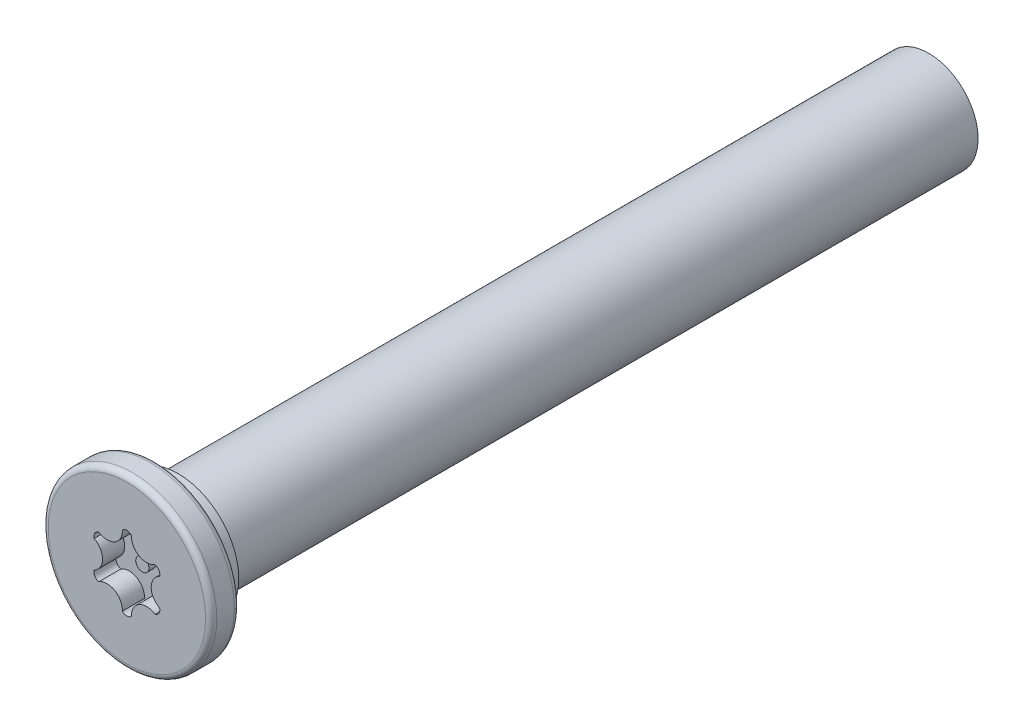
ISO-10303-21;
HEADER;
FILE_DESCRIPTION(('STEP AP214'),'2;1');
FILE_NAME('part.step','',(''),(''),'','','');
FILE_SCHEMA(('AUTOMOTIVE_DESIGN { 1 0 10303 214 1 1 1 1 }'));
ENDSEC;
DATA;
#1=APPLICATION_CONTEXT('core data for automotive mechanical design processes');
#2=APPLICATION_PROTOCOL_DEFINITION('international standard','automotive_design',2000,#1);
#3=PRODUCT_CONTEXT('',#1,'mechanical');
#4=PRODUCT('Part','Part','',(#3));
#5=PRODUCT_RELATED_PRODUCT_CATEGORY('part','',(#4));
#6=PRODUCT_DEFINITION_FORMATION('','',#4);
#7=PRODUCT_DEFINITION_CONTEXT('part definition',#1,'design');
#8=PRODUCT_DEFINITION('design','',#6,#7);
#9=PRODUCT_DEFINITION_SHAPE('','',#8);
#10=(LENGTH_UNIT() NAMED_UNIT(*) SI_UNIT(.MILLI.,.METRE.));
#11=(NAMED_UNIT(*) PLANE_ANGLE_UNIT() SI_UNIT($,.RADIAN.));
#12=(NAMED_UNIT(*) SI_UNIT($,.STERADIAN.) SOLID_ANGLE_UNIT());
#13=UNCERTAINTY_MEASURE_WITH_UNIT(LENGTH_MEASURE(1.E-05),#10,'distance_accuracy_value','');
#14=(GEOMETRIC_REPRESENTATION_CONTEXT(3) GLOBAL_UNCERTAINTY_ASSIGNED_CONTEXT((#13)) GLOBAL_UNIT_ASSIGNED_CONTEXT((#10,
#11,#12)) REPRESENTATION_CONTEXT('',''));
#15=CARTESIAN_POINT('',(0.,0.,0.));
#16=DIRECTION('',(0.,0.,1.));
#17=DIRECTION('',(1.,0.,0.));
#18=AXIS2_PLACEMENT_3D('',#15,#16,#17);
#19=CARTESIAN_POINT('',(0.,0.,0.));
#20=DIRECTION('',(0.,0.,1.));
#21=DIRECTION('',(1.,0.,0.));
#22=AXIS2_PLACEMENT_3D('',#19,#20,#21);
#23=PLANE('',#22);
#24=CARTESIAN_POINT('',(0.,0.,0.));
#25=DIRECTION('',(0.,0.,1.));
#26=DIRECTION('',(1.,0.,0.));
#27=AXIS2_PLACEMENT_3D('',#24,#25,#26);
#28=CIRCLE('',#27,3.55599999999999);
#29=CARTESIAN_POINT('',(3.55599999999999,0.,0.));
#30=VERTEX_POINT('',#29);
#31=EDGE_CURVE('E54',#30,#30,#28,.T.);
#32=ORIENTED_EDGE('',*,*,#31,.T.);
#33=EDGE_LOOP('',(#32));
#34=FACE_BOUND('',#33,.T.);
#35=CARTESIAN_POINT('',(0.893828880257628,1.54815703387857,0.));
#36=DIRECTION('',(0.,0.,1.));
#37=DIRECTION('',(1.,0.,0.));
#38=AXIS2_PLACEMENT_3D('',#35,#36,#37);
#39=CIRCLE('',#38,0.69);
#40=CARTESIAN_POINT('',(0.205060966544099,1.58937306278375,0.));
#41=VERTEX_POINT('',#40);
#42=CARTESIAN_POINT('',(1.27390696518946,0.972274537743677,0.));
#43=VERTEX_POINT('',#42);
#44=EDGE_CURVE('E181',#41,#43,#39,.T.);
#45=ORIENTED_EDGE('',*,*,#44,.T.);
#46=CARTESIAN_POINT('',(1.19884944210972,0.692156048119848,0.));
#47=DIRECTION('',(0.,0.,1.));
#48=DIRECTION('',(1.,0.,0.));
#49=AXIS2_PLACEMENT_3D('',#46,#47,#48);
#50=CIRCLE('',#49,0.29);
#51=CARTESIAN_POINT('',(1.47896793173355,0.617098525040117,0.));
#52=VERTEX_POINT('',#51);
#53=EDGE_CURVE('E61',#43,#52,#50,.F.);
#54=ORIENTED_EDGE('',*,*,#53,.T.);
#55=CARTESIAN_POINT('',(1.78765776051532,0.,0.));
#56=DIRECTION('',(0.,0.,1.));
#57=DIRECTION('',(1.,0.,0.));
#58=AXIS2_PLACEMENT_3D('',#55,#56,#57);
#59=CIRCLE('',#58,0.69);
#60=CARTESIAN_POINT('',(1.47896793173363,-0.617098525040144,0.));
#61=VERTEX_POINT('',#60);
#62=EDGE_CURVE('E111',#52,#61,#59,.T.);
#63=ORIENTED_EDGE('',*,*,#62,.T.);
#64=CARTESIAN_POINT('',(1.1988494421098,-0.692156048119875,0.));
#65=DIRECTION('',(0.,0.,1.));
#66=DIRECTION('',(1.,0.,0.));
#67=AXIS2_PLACEMENT_3D('',#64,#65,#66);
#68=CIRCLE('',#67,0.29);
#69=CARTESIAN_POINT('',(1.27390696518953,-0.972274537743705,0.));
#70=VERTEX_POINT('',#69);
#71=EDGE_CURVE('E216',#61,#70,#68,.F.);
#72=ORIENTED_EDGE('',*,*,#71,.T.);
#73=CARTESIAN_POINT('',(0.893828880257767,-1.54815703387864,0.));
#74=DIRECTION('',(0.,0.,1.));
#75=DIRECTION('',(1.,0.,0.));
#76=AXIS2_PLACEMENT_3D('',#73,#74,#75);
#77=CIRCLE('',#76,0.69);
#78=CARTESIAN_POINT('',(0.205060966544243,-1.5893730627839,0.));
#79=VERTEX_POINT('',#78);
#80=EDGE_CURVE('E160',#70,#79,#77,.T.);
#81=ORIENTED_EDGE('',*,*,#80,.T.);
#82=CARTESIAN_POINT('',(1.43067375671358E-13,-1.3843120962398,0.));
#83=DIRECTION('',(0.,0.,1.));
#84=DIRECTION('',(1.,0.,0.));
#85=AXIS2_PLACEMENT_3D('',#82,#83,#84);
#86=CIRCLE('',#85,0.29);
#87=CARTESIAN_POINT('',(-0.205060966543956,-1.5893730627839,0.));
#88=VERTEX_POINT('',#87);
#89=EDGE_CURVE('E210',#79,#88,#86,.F.);
#90=ORIENTED_EDGE('',*,*,#89,.T.);
#91=CARTESIAN_POINT('',(-0.893828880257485,-1.54815703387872,0.));
#92=DIRECTION('',(0.,0.,1.));
#93=DIRECTION('',(1.,0.,0.));
#94=AXIS2_PLACEMENT_3D('',#91,#92,#93);
#95=CIRCLE('',#94,0.69);
#96=CARTESIAN_POINT('',(-1.27390696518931,-0.97227453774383,0.));
#97=VERTEX_POINT('',#96);
#98=EDGE_CURVE('E206',#88,#97,#95,.T.);
#99=ORIENTED_EDGE('',*,*,#98,.T.);
#100=CARTESIAN_POINT('',(-1.19884944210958,-0.69215604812,0.));
#101=DIRECTION('',(0.,0.,1.));
#102=DIRECTION('',(1.,0.,0.));
#103=AXIS2_PLACEMENT_3D('',#100,#101,#102);
#104=CIRCLE('',#103,0.29);
#105=CARTESIAN_POINT('',(-1.47896793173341,-0.617098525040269,0.));
#106=VERTEX_POINT('',#105);
#107=EDGE_CURVE('E202',#97,#106,#104,.F.);
#108=ORIENTED_EDGE('',*,*,#107,.T.);
#109=CARTESIAN_POINT('',(-1.78765776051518,-1.56674837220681E-13,0.));
#110=DIRECTION('',(0.,0.,1.));
#111=DIRECTION('',(1.,0.,0.));
#112=AXIS2_PLACEMENT_3D('',#109,#110,#111);
#113=CIRCLE('',#112,0.69);
#114=CARTESIAN_POINT('',(-1.47896793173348,0.617098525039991,0.));
#115=VERTEX_POINT('',#114);
#116=EDGE_CURVE('E198',#106,#115,#113,.T.);
#117=ORIENTED_EDGE('',*,*,#116,.T.);
#118=CARTESIAN_POINT('',(-1.19884944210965,0.692156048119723,0.));
#119=DIRECTION('',(0.,0.,1.));
#120=DIRECTION('',(1.,0.,0.));
#121=AXIS2_PLACEMENT_3D('',#118,#119,#120);
#122=CIRCLE('',#121,0.29);
#123=CARTESIAN_POINT('',(-1.27390696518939,0.972274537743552,0.));
#124=VERTEX_POINT('',#123);
#125=EDGE_CURVE('E194',#115,#124,#122,.F.);
#126=ORIENTED_EDGE('',*,*,#125,.T.);
#127=CARTESIAN_POINT('',(-0.893828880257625,1.54815703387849,0.));
#128=DIRECTION('',(0.,0.,1.));
#129=DIRECTION('',(1.,0.,0.));
#130=AXIS2_PLACEMENT_3D('',#127,#128,#129);
#131=CIRCLE('',#130,0.690000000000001);
#132=CARTESIAN_POINT('',(-0.205060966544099,1.58937306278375,0.));
#133=VERTEX_POINT('',#132);
#134=EDGE_CURVE('E190',#124,#133,#131,.T.);
#135=ORIENTED_EDGE('',*,*,#134,.T.);
#136=CARTESIAN_POINT('',(0.,1.38431209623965,0.));
#137=DIRECTION('',(0.,0.,1.));
#138=DIRECTION('',(1.,0.,0.));
#139=AXIS2_PLACEMENT_3D('',#136,#137,#138);
#140=CIRCLE('',#139,0.29);
#141=EDGE_CURVE('E186',#133,#41,#140,.F.);
#142=ORIENTED_EDGE('',*,*,#141,.T.);
#143=EDGE_LOOP('',(#45,#54,#63,#72,#81,#90,#99,#108,#117,#126,#135,#142));
#144=FACE_BOUND('',#143,.T.);
#145=ADVANCED_FACE('F45',(#34,#144),#23,.T.);
#146=CARTESIAN_POINT('',(0.,0.,-1.3));
#147=DIRECTION('',(0.,0.,1.));
#148=DIRECTION('',(1.,0.,0.));
#149=AXIS2_PLACEMENT_3D('',#146,#147,#148);
#150=PLANE('',#149);
#151=CARTESIAN_POINT('',(0.,0.,-1.3));
#152=DIRECTION('',(0.,0.,1.));
#153=DIRECTION('',(1.,0.,0.));
#154=AXIS2_PLACEMENT_3D('',#151,#152,#153);
#155=CIRCLE('',#154,2.738000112);
#156=CARTESIAN_POINT('',(2.738000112,0.,-1.3));
#157=VERTEX_POINT('',#156);
#158=EDGE_CURVE('E11',#157,#157,#155,.F.);
#159=ORIENTED_EDGE('',*,*,#158,.F.);
#160=EDGE_LOOP('',(#159));
#161=FACE_BOUND('',#160,.T.);
#162=CARTESIAN_POINT('',(0.,0.,-1.3));
#163=DIRECTION('',(0.,0.,1.));
#164=DIRECTION('',(1.,0.,0.));
#165=AXIS2_PLACEMENT_3D('',#162,#163,#164);
#166=CIRCLE('',#165,3.55599999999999);
#167=CARTESIAN_POINT('',(3.55599999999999,0.,-1.3));
#168=VERTEX_POINT('',#167);
#169=EDGE_CURVE('E260',#168,#168,#166,.F.);
#170=ORIENTED_EDGE('',*,*,#169,.T.);
#171=EDGE_LOOP('',(#170));
#172=FACE_BOUND('',#171,.T.);
#173=ADVANCED_FACE('F283',(#161,#172),#150,.F.);
#174=CARTESIAN_POINT('',(0.,0.,-1.3));
#175=DIRECTION('',(0.,0.,1.));
#176=DIRECTION('',(1.,0.,0.));
#177=AXIS2_PLACEMENT_3D('',#174,#175,#176);
#178=CYLINDRICAL_SURFACE('',#177,3.80999999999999);
#179=CARTESIAN_POINT('',(0.,0.,-1.046));
#180=DIRECTION('',(0.,0.,1.));
#181=DIRECTION('',(1.,0.,0.));
#182=AXIS2_PLACEMENT_3D('',#179,#180,#181);
#183=CIRCLE('',#182,3.80999999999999);
#184=CARTESIAN_POINT('',(3.80999999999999,0.,-1.046));
#185=VERTEX_POINT('',#184);
#186=EDGE_CURVE('E256',#185,#185,#183,.T.);
#187=ORIENTED_EDGE('',*,*,#186,.T.);
#188=EDGE_LOOP('',(#187));
#189=FACE_BOUND('',#188,.T.);
#190=CARTESIAN_POINT('',(0.,0.,-0.254));
#191=DIRECTION('',(0.,0.,1.));
#192=DIRECTION('',(1.,0.,0.));
#193=AXIS2_PLACEMENT_3D('',#190,#191,#192);
#194=CIRCLE('',#193,3.80999999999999);
#195=CARTESIAN_POINT('',(3.80999999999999,0.,-0.254));
#196=VERTEX_POINT('',#195);
#197=EDGE_CURVE('E225',#196,#196,#194,.F.);
#198=ORIENTED_EDGE('',*,*,#197,.T.);
#199=EDGE_LOOP('',(#198));
#200=FACE_BOUND('',#199,.T.);
#201=ADVANCED_FACE('F289',(#189,#200),#178,.T.);
#202=CARTESIAN_POINT('',(1.19884944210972,0.692156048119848,-1.));
#203=DIRECTION('',(0.,0.,1.));
#204=DIRECTION('',(1.,0.,0.));
#205=AXIS2_PLACEMENT_3D('',#202,#203,#204);
#206=CYLINDRICAL_SURFACE('',#205,0.29);
#207=ORIENTED_EDGE('',*,*,#53,.F.);
#208=DIRECTION('',(0.,0.,1.));
#209=VECTOR('',#208,1.);
#210=CARTESIAN_POINT('',(1.27390696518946,0.972274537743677,-1.));
#211=LINE('',#210,#209);
#212=CARTESIAN_POINT('',(1.27390696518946,0.972274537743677,-1.));
#213=VERTEX_POINT('',#212);
#214=EDGE_CURVE('E178',#213,#43,#211,.T.);
#215=ORIENTED_EDGE('',*,*,#214,.F.);
#216=CARTESIAN_POINT('',(1.19884944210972,0.692156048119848,-1.));
#217=DIRECTION('',(0.,0.,1.));
#218=DIRECTION('',(1.,0.,0.));
#219=AXIS2_PLACEMENT_3D('',#216,#217,#218);
#220=CIRCLE('',#219,0.29);
#221=CARTESIAN_POINT('',(1.47896793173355,0.617098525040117,-1.));
#222=VERTEX_POINT('',#221);
#223=EDGE_CURVE('E221',#213,#222,#220,.F.);
#224=ORIENTED_EDGE('',*,*,#223,.T.);
#225=DIRECTION('',(0.,0.,1.));
#226=VECTOR('',#225,1.);
#227=CARTESIAN_POINT('',(1.47896793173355,0.617098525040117,-1.));
#228=LINE('',#227,#226);
#229=EDGE_CURVE('E222',#222,#52,#228,.T.);
#230=ORIENTED_EDGE('',*,*,#229,.T.);
#231=EDGE_LOOP('',(#207,#215,#224,#230));
#232=FACE_BOUND('',#231,.T.);
#233=ADVANCED_FACE('F294',(#232),#206,.F.);
#234=CARTESIAN_POINT('',(1.78765776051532,0.,-1.));
#235=DIRECTION('',(0.,0.,1.));
#236=DIRECTION('',(1.,0.,0.));
#237=AXIS2_PLACEMENT_3D('',#234,#235,#236);
#238=CYLINDRICAL_SURFACE('',#237,0.69);
#239=ORIENTED_EDGE('',*,*,#62,.F.);
#240=ORIENTED_EDGE('',*,*,#229,.F.);
#241=CARTESIAN_POINT('',(1.78765776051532,0.,-1.));
#242=DIRECTION('',(0.,0.,1.));
#243=DIRECTION('',(1.,0.,0.));
#244=AXIS2_PLACEMENT_3D('',#241,#242,#243);
#245=CIRCLE('',#244,0.69);
#246=CARTESIAN_POINT('',(1.47896793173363,-0.617098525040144,-1.));
#247=VERTEX_POINT('',#246);
#248=EDGE_CURVE('E70',#222,#247,#245,.T.);
#249=ORIENTED_EDGE('',*,*,#248,.T.);
#250=DIRECTION('',(0.,0.,1.));
#251=VECTOR('',#250,1.);
#252=CARTESIAN_POINT('',(1.47896793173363,-0.617098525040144,-1.));
#253=LINE('',#252,#251);
#254=EDGE_CURVE('E151',#247,#61,#253,.T.);
#255=ORIENTED_EDGE('',*,*,#254,.T.);
#256=EDGE_LOOP('',(#239,#240,#249,#255));
#257=FACE_BOUND('',#256,.T.);
#258=ADVANCED_FACE('F301',(#257),#238,.T.);
#259=CARTESIAN_POINT('',(1.1988494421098,-0.692156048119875,-1.));
#260=DIRECTION('',(0.,0.,1.));
#261=DIRECTION('',(1.,0.,0.));
#262=AXIS2_PLACEMENT_3D('',#259,#260,#261);
#263=CYLINDRICAL_SURFACE('',#262,0.29);
#264=ORIENTED_EDGE('',*,*,#71,.F.);
#265=ORIENTED_EDGE('',*,*,#254,.F.);
#266=CARTESIAN_POINT('',(1.1988494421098,-0.692156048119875,-1.));
#267=DIRECTION('',(0.,0.,1.));
#268=DIRECTION('',(1.,0.,0.));
#269=AXIS2_PLACEMENT_3D('',#266,#267,#268);
#270=CIRCLE('',#269,0.29);
#271=CARTESIAN_POINT('',(1.27390696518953,-0.972274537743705,-1.));
#272=VERTEX_POINT('',#271);
#273=EDGE_CURVE('E145',#247,#272,#270,.F.);
#274=ORIENTED_EDGE('',*,*,#273,.T.);
#275=DIRECTION('',(0.,0.,1.));
#276=VECTOR('',#275,1.);
#277=CARTESIAN_POINT('',(1.27390696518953,-0.972274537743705,-1.));
#278=LINE('',#277,#276);
#279=EDGE_CURVE('E149',#272,#70,#278,.T.);
#280=ORIENTED_EDGE('',*,*,#279,.T.);
#281=EDGE_LOOP('',(#264,#265,#274,#280));
#282=FACE_BOUND('',#281,.T.);
#283=ADVANCED_FACE('F148',(#282),#263,.F.);
#284=CARTESIAN_POINT('',(0.893828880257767,-1.54815703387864,-1.));
#285=DIRECTION('',(0.,0.,1.));
#286=DIRECTION('',(1.,0.,0.));
#287=AXIS2_PLACEMENT_3D('',#284,#285,#286);
#288=CYLINDRICAL_SURFACE('',#287,0.69);
#289=ORIENTED_EDGE('',*,*,#80,.F.);
#290=ORIENTED_EDGE('',*,*,#279,.F.);
#291=CARTESIAN_POINT('',(0.893828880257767,-1.54815703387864,-1.));
#292=DIRECTION('',(0.,0.,1.));
#293=DIRECTION('',(1.,0.,0.));
#294=AXIS2_PLACEMENT_3D('',#291,#292,#293);
#295=CIRCLE('',#294,0.69);
#296=CARTESIAN_POINT('',(0.205060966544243,-1.5893730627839,-1.));
#297=VERTEX_POINT('',#296);
#298=EDGE_CURVE('E154',#272,#297,#295,.T.);
#299=ORIENTED_EDGE('',*,*,#298,.T.);
#300=DIRECTION('',(0.,0.,1.));
#301=VECTOR('',#300,1.);
#302=CARTESIAN_POINT('',(0.205060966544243,-1.5893730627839,-1.));
#303=LINE('',#302,#301);
#304=EDGE_CURVE('E163',#297,#79,#303,.T.);
#305=ORIENTED_EDGE('',*,*,#304,.T.);
#306=EDGE_LOOP('',(#289,#290,#299,#305));
#307=FACE_BOUND('',#306,.T.);
#308=ADVANCED_FACE('F157',(#307),#288,.T.);
#309=CARTESIAN_POINT('',(1.43067375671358E-13,-1.3843120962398,-1.));
#310=DIRECTION('',(0.,0.,1.));
#311=DIRECTION('',(1.,0.,0.));
#312=AXIS2_PLACEMENT_3D('',#309,#310,#311);
#313=CYLINDRICAL_SURFACE('',#312,0.29);
#314=ORIENTED_EDGE('',*,*,#89,.F.);
#315=ORIENTED_EDGE('',*,*,#304,.F.);
#316=CARTESIAN_POINT('',(1.43067375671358E-13,-1.3843120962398,-1.));
#317=DIRECTION('',(0.,0.,1.));
#318=DIRECTION('',(1.,0.,0.));
#319=AXIS2_PLACEMENT_3D('',#316,#317,#318);
#320=CIRCLE('',#319,0.29);
#321=CARTESIAN_POINT('',(-0.205060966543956,-1.5893730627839,-1.));
#322=VERTEX_POINT('',#321);
#323=EDGE_CURVE('E168',#297,#322,#320,.F.);
#324=ORIENTED_EDGE('',*,*,#323,.T.);
#325=DIRECTION('',(0.,0.,1.));
#326=VECTOR('',#325,1.);
#327=CARTESIAN_POINT('',(-0.205060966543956,-1.5893730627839,-1.));
#328=LINE('',#327,#326);
#329=EDGE_CURVE('E230',#322,#88,#328,.T.);
#330=ORIENTED_EDGE('',*,*,#329,.T.);
#331=EDGE_LOOP('',(#314,#315,#324,#330));
#332=FACE_BOUND('',#331,.T.);
#333=ADVANCED_FACE('F318',(#332),#313,.F.);
#334=CARTESIAN_POINT('',(-0.893828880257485,-1.54815703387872,-1.));
#335=DIRECTION('',(0.,0.,1.));
#336=DIRECTION('',(1.,0.,0.));
#337=AXIS2_PLACEMENT_3D('',#334,#335,#336);
#338=CYLINDRICAL_SURFACE('',#337,0.69);
#339=ORIENTED_EDGE('',*,*,#98,.F.);
#340=ORIENTED_EDGE('',*,*,#329,.F.);
#341=CARTESIAN_POINT('',(-0.893828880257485,-1.54815703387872,-1.));
#342=DIRECTION('',(0.,0.,1.));
#343=DIRECTION('',(1.,0.,0.));
#344=AXIS2_PLACEMENT_3D('',#341,#342,#343);
#345=CIRCLE('',#344,0.69);
#346=CARTESIAN_POINT('',(-1.27390696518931,-0.97227453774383,-1.));
#347=VERTEX_POINT('',#346);
#348=EDGE_CURVE('E172',#322,#347,#345,.T.);
#349=ORIENTED_EDGE('',*,*,#348,.T.);
#350=DIRECTION('',(0.,0.,1.));
#351=VECTOR('',#350,1.);
#352=CARTESIAN_POINT('',(-1.27390696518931,-0.97227453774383,-1.));
#353=LINE('',#352,#351);
#354=EDGE_CURVE('E233',#347,#97,#353,.T.);
#355=ORIENTED_EDGE('',*,*,#354,.T.);
#356=EDGE_LOOP('',(#339,#340,#349,#355));
#357=FACE_BOUND('',#356,.T.);
#358=ADVANCED_FACE('F321',(#357),#338,.T.);
#359=CARTESIAN_POINT('',(-1.19884944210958,-0.69215604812,-1.));
#360=DIRECTION('',(0.,0.,1.));
#361=DIRECTION('',(1.,0.,0.));
#362=AXIS2_PLACEMENT_3D('',#359,#360,#361);
#363=CYLINDRICAL_SURFACE('',#362,0.29);
#364=ORIENTED_EDGE('',*,*,#107,.F.);
#365=ORIENTED_EDGE('',*,*,#354,.F.);
#366=CARTESIAN_POINT('',(-1.19884944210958,-0.69215604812,-1.));
#367=DIRECTION('',(0.,0.,1.));
#368=DIRECTION('',(1.,0.,0.));
#369=AXIS2_PLACEMENT_3D('',#366,#367,#368);
#370=CIRCLE('',#369,0.29);
#371=CARTESIAN_POINT('',(-1.47896793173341,-0.617098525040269,-1.));
#372=VERTEX_POINT('',#371);
#373=EDGE_CURVE('E374',#347,#372,#370,.F.);
#374=ORIENTED_EDGE('',*,*,#373,.T.);
#375=DIRECTION('',(0.,0.,1.));
#376=VECTOR('',#375,1.);
#377=CARTESIAN_POINT('',(-1.47896793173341,-0.617098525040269,-1.));
#378=LINE('',#377,#376);
#379=EDGE_CURVE('E236',#372,#106,#378,.T.);
#380=ORIENTED_EDGE('',*,*,#379,.T.);
#381=EDGE_LOOP('',(#364,#365,#374,#380));
#382=FACE_BOUND('',#381,.T.);
#383=ADVANCED_FACE('F325',(#382),#363,.F.);
#384=CARTESIAN_POINT('',(-1.78765776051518,-1.56674837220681E-13,-1.));
#385=DIRECTION('',(0.,0.,1.));
#386=DIRECTION('',(1.,0.,0.));
#387=AXIS2_PLACEMENT_3D('',#384,#385,#386);
#388=CYLINDRICAL_SURFACE('',#387,0.69);
#389=ORIENTED_EDGE('',*,*,#116,.F.);
#390=ORIENTED_EDGE('',*,*,#379,.F.);
#391=CARTESIAN_POINT('',(-1.78765776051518,-1.56674837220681E-13,-1.));
#392=DIRECTION('',(0.,0.,1.));
#393=DIRECTION('',(1.,0.,0.));
#394=AXIS2_PLACEMENT_3D('',#391,#392,#393);
#395=CIRCLE('',#394,0.69);
#396=CARTESIAN_POINT('',(-1.47896793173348,0.617098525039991,-1.));
#397=VERTEX_POINT('',#396);
#398=EDGE_CURVE('E371',#372,#397,#395,.T.);
#399=ORIENTED_EDGE('',*,*,#398,.T.);
#400=DIRECTION('',(0.,0.,1.));
#401=VECTOR('',#400,1.);
#402=CARTESIAN_POINT('',(-1.47896793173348,0.617098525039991,-1.));
#403=LINE('',#402,#401);
#404=EDGE_CURVE('E239',#397,#115,#403,.T.);
#405=ORIENTED_EDGE('',*,*,#404,.T.);
#406=EDGE_LOOP('',(#389,#390,#399,#405));
#407=FACE_BOUND('',#406,.T.);
#408=ADVANCED_FACE('F329',(#407),#388,.T.);
#409=CARTESIAN_POINT('',(-1.19884944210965,0.692156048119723,-1.));
#410=DIRECTION('',(0.,0.,1.));
#411=DIRECTION('',(1.,0.,0.));
#412=AXIS2_PLACEMENT_3D('',#409,#410,#411);
#413=CYLINDRICAL_SURFACE('',#412,0.29);
#414=ORIENTED_EDGE('',*,*,#125,.F.);
#415=ORIENTED_EDGE('',*,*,#404,.F.);
#416=CARTESIAN_POINT('',(-1.19884944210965,0.692156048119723,-1.));
#417=DIRECTION('',(0.,0.,1.));
#418=DIRECTION('',(1.,0.,0.));
#419=AXIS2_PLACEMENT_3D('',#416,#417,#418);
#420=CIRCLE('',#419,0.29);
#421=CARTESIAN_POINT('',(-1.27390696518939,0.972274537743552,-1.));
#422=VERTEX_POINT('',#421);
#423=EDGE_CURVE('E364',#397,#422,#420,.F.);
#424=ORIENTED_EDGE('',*,*,#423,.T.);
#425=DIRECTION('',(0.,0.,1.));
#426=VECTOR('',#425,1.);
#427=CARTESIAN_POINT('',(-1.27390696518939,0.972274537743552,-1.));
#428=LINE('',#427,#426);
#429=EDGE_CURVE('E242',#422,#124,#428,.T.);
#430=ORIENTED_EDGE('',*,*,#429,.T.);
#431=EDGE_LOOP('',(#414,#415,#424,#430));
#432=FACE_BOUND('',#431,.T.);
#433=ADVANCED_FACE('F333',(#432),#413,.F.);
#434=CARTESIAN_POINT('',(-0.893828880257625,1.54815703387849,-1.));
#435=DIRECTION('',(0.,0.,1.));
#436=DIRECTION('',(1.,0.,0.));
#437=AXIS2_PLACEMENT_3D('',#434,#435,#436);
#438=CYLINDRICAL_SURFACE('',#437,0.690000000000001);
#439=ORIENTED_EDGE('',*,*,#134,.F.);
#440=ORIENTED_EDGE('',*,*,#429,.F.);
#441=CARTESIAN_POINT('',(-0.893828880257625,1.54815703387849,-1.));
#442=DIRECTION('',(0.,0.,1.));
#443=DIRECTION('',(1.,0.,0.));
#444=AXIS2_PLACEMENT_3D('',#441,#442,#443);
#445=CIRCLE('',#444,0.690000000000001);
#446=CARTESIAN_POINT('',(-0.205060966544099,1.58937306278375,-1.));
#447=VERTEX_POINT('',#446);
#448=EDGE_CURVE('E360',#422,#447,#445,.T.);
#449=ORIENTED_EDGE('',*,*,#448,.T.);
#450=DIRECTION('',(0.,0.,1.));
#451=VECTOR('',#450,1.);
#452=CARTESIAN_POINT('',(-0.205060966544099,1.58937306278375,-1.));
#453=LINE('',#452,#451);
#454=EDGE_CURVE('E245',#447,#133,#453,.T.);
#455=ORIENTED_EDGE('',*,*,#454,.T.);
#456=EDGE_LOOP('',(#439,#440,#449,#455));
#457=FACE_BOUND('',#456,.T.);
#458=ADVANCED_FACE('F337',(#457),#438,.T.);
#459=CARTESIAN_POINT('',(0.,1.38431209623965,-1.));
#460=DIRECTION('',(0.,0.,1.));
#461=DIRECTION('',(1.,0.,0.));
#462=AXIS2_PLACEMENT_3D('',#459,#460,#461);
#463=CYLINDRICAL_SURFACE('',#462,0.29);
#464=ORIENTED_EDGE('',*,*,#141,.F.);
#465=ORIENTED_EDGE('',*,*,#454,.F.);
#466=CARTESIAN_POINT('',(0.,1.38431209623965,-1.));
#467=DIRECTION('',(0.,0.,1.));
#468=DIRECTION('',(1.,0.,0.));
#469=AXIS2_PLACEMENT_3D('',#466,#467,#468);
#470=CIRCLE('',#469,0.29);
#471=CARTESIAN_POINT('',(0.205060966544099,1.58937306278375,-1.));
#472=VERTEX_POINT('',#471);
#473=EDGE_CURVE('E357',#447,#472,#470,.F.);
#474=ORIENTED_EDGE('',*,*,#473,.T.);
#475=DIRECTION('',(0.,0.,1.));
#476=VECTOR('',#475,1.);
#477=CARTESIAN_POINT('',(0.205060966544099,1.58937306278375,-1.));
#478=LINE('',#477,#476);
#479=EDGE_CURVE('E248',#472,#41,#478,.T.);
#480=ORIENTED_EDGE('',*,*,#479,.T.);
#481=EDGE_LOOP('',(#464,#465,#474,#480));
#482=FACE_BOUND('',#481,.T.);
#483=ADVANCED_FACE('F341',(#482),#463,.F.);
#484=CARTESIAN_POINT('',(0.893828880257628,1.54815703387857,-1.));
#485=DIRECTION('',(0.,0.,1.));
#486=DIRECTION('',(1.,0.,0.));
#487=AXIS2_PLACEMENT_3D('',#484,#485,#486);
#488=CYLINDRICAL_SURFACE('',#487,0.69);
#489=ORIENTED_EDGE('',*,*,#44,.F.);
#490=ORIENTED_EDGE('',*,*,#479,.F.);
#491=CARTESIAN_POINT('',(0.893828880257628,1.54815703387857,-1.));
#492=DIRECTION('',(0.,0.,1.));
#493=DIRECTION('',(1.,0.,0.));
#494=AXIS2_PLACEMENT_3D('',#491,#492,#493);
#495=CIRCLE('',#494,0.69);
#496=EDGE_CURVE('E118',#472,#213,#495,.T.);
#497=ORIENTED_EDGE('',*,*,#496,.T.);
#498=ORIENTED_EDGE('',*,*,#214,.T.);
#499=EDGE_LOOP('',(#489,#490,#497,#498));
#500=FACE_BOUND('',#499,.T.);
#501=ADVANCED_FACE('F344',(#500),#488,.T.);
#502=CARTESIAN_POINT('',(0.,0.,-1.));
#503=DIRECTION('',(0.,0.,1.));
#504=DIRECTION('',(1.,0.,0.));
#505=AXIS2_PLACEMENT_3D('',#502,#503,#504);
#506=PLANE('',#505);
#507=CARTESIAN_POINT('',(0.,0.,-1.));
#508=DIRECTION('',(0.,0.,1.));
#509=DIRECTION('',(1.,0.,0.));
#510=AXIS2_PLACEMENT_3D('',#507,#508,#509);
#511=CIRCLE('',#510,0.3);
#512=CARTESIAN_POINT('',(0.3,0.,-1.));
#513=VERTEX_POINT('',#512);
#514=EDGE_CURVE('E396',#513,#513,#511,.T.);
#515=ORIENTED_EDGE('',*,*,#514,.F.);
#516=EDGE_LOOP('',(#515));
#517=FACE_BOUND('',#516,.T.);
#518=ORIENTED_EDGE('',*,*,#223,.F.);
#519=ORIENTED_EDGE('',*,*,#496,.F.);
#520=ORIENTED_EDGE('',*,*,#473,.F.);
#521=ORIENTED_EDGE('',*,*,#448,.F.);
#522=ORIENTED_EDGE('',*,*,#423,.F.);
#523=ORIENTED_EDGE('',*,*,#398,.F.);
#524=ORIENTED_EDGE('',*,*,#373,.F.);
#525=ORIENTED_EDGE('',*,*,#348,.F.);
#526=ORIENTED_EDGE('',*,*,#323,.F.);
#527=ORIENTED_EDGE('',*,*,#298,.F.);
#528=ORIENTED_EDGE('',*,*,#273,.F.);
#529=ORIENTED_EDGE('',*,*,#248,.F.);
#530=EDGE_LOOP('',(#518,#519,#520,#521,#522,#523,#524,#525,#526,#527,#528,#529));
#531=FACE_BOUND('',#530,.T.);
#532=ADVANCED_FACE('F166',(#517,#531),#506,.T.);
#533=CARTESIAN_POINT('',(0.,0.,-1.046));
#534=DIRECTION('',(0.,0.,1.));
#535=DIRECTION('',(1.,0.,0.));
#536=AXIS2_PLACEMENT_3D('',#533,#534,#535);
#537=TOROIDAL_SURFACE('',#536,3.55599999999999,0.254);
#538=ORIENTED_EDGE('',*,*,#169,.F.);
#539=EDGE_LOOP('',(#538));
#540=FACE_BOUND('',#539,.T.);
#541=ORIENTED_EDGE('',*,*,#186,.F.);
#542=EDGE_LOOP('',(#541));
#543=FACE_BOUND('',#542,.T.);
#544=ADVANCED_FACE('F271',(#540,#543),#537,.T.);
#545=CARTESIAN_POINT('',(0.,0.,-0.254));
#546=DIRECTION('',(0.,0.,1.));
#547=DIRECTION('',(1.,0.,0.));
#548=AXIS2_PLACEMENT_3D('',#545,#546,#547);
#549=TOROIDAL_SURFACE('',#548,3.55599999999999,0.254);
#550=ORIENTED_EDGE('',*,*,#197,.F.);
#551=EDGE_LOOP('',(#550));
#552=FACE_BOUND('',#551,.T.);
#553=ORIENTED_EDGE('',*,*,#31,.F.);
#554=EDGE_LOOP('',(#553));
#555=FACE_BOUND('',#554,.T.);
#556=ADVANCED_FACE('F47',(#552,#555),#549,.T.);
#557=CARTESIAN_POINT('',(0.,0.,-2.316));
#558=DIRECTION('',(0.,0.,-1.));
#559=DIRECTION('',(-1.,0.,0.));
#560=AXIS2_PLACEMENT_3D('',#557,#558,#559);
#561=PLANE('',#560);
#562=CARTESIAN_POINT('',(0.,0.,-2.316));
#563=DIRECTION('',(0.,0.,-1.));
#564=DIRECTION('',(-1.,0.,0.));
#565=AXIS2_PLACEMENT_3D('',#562,#563,#564);
#566=CIRCLE('',#565,2.738000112);
#567=CARTESIAN_POINT('',(-2.738000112,0.,-2.316));
#568=VERTEX_POINT('',#567);
#569=EDGE_CURVE('E182',#568,#568,#566,.T.);
#570=ORIENTED_EDGE('',*,*,#569,.T.);
#571=EDGE_LOOP('',(#570));
#572=FACE_BOUND('',#571,.T.);
#573=CARTESIAN_POINT('',(0.,0.,-2.316));
#574=DIRECTION('',(0.,0.,-1.));
#575=DIRECTION('',(-1.,0.,0.));
#576=AXIS2_PLACEMENT_3D('',#573,#574,#575);
#577=CIRCLE('',#576,2.230000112);
#578=CARTESIAN_POINT('',(-2.230000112,0.,-2.316));
#579=VERTEX_POINT('',#578);
#580=EDGE_CURVE('E400',#579,#579,#577,.T.);
#581=ORIENTED_EDGE('',*,*,#580,.F.);
#582=EDGE_LOOP('',(#581));
#583=FACE_BOUND('',#582,.T.);
#584=ADVANCED_FACE('F270',(#572,#583),#561,.T.);
#585=CARTESIAN_POINT('',(0.,0.,-2.316));
#586=DIRECTION('',(0.,0.,1.));
#587=DIRECTION('',(1.,0.,0.));
#588=AXIS2_PLACEMENT_3D('',#585,#586,#587);
#589=CYLINDRICAL_SURFACE('',#588,2.738000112);
#590=ORIENTED_EDGE('',*,*,#569,.F.);
#591=EDGE_LOOP('',(#590));
#592=FACE_BOUND('',#591,.T.);
#593=ORIENTED_EDGE('',*,*,#158,.T.);
#594=EDGE_LOOP('',(#593));
#595=FACE_BOUND('',#594,.T.);
#596=ADVANCED_FACE('F277',(#592,#595),#589,.T.);
#597=CARTESIAN_POINT('',(0.,0.,-0.7));
#598=DIRECTION('',(0.,0.,-1.));
#599=DIRECTION('',(-1.,0.,0.));
#600=AXIS2_PLACEMENT_3D('',#597,#598,#599);
#601=CYLINDRICAL_SURFACE('',#600,0.3);
#602=CARTESIAN_POINT('',(0.,0.,-0.7));
#603=DIRECTION('',(0.,0.,1.));
#604=DIRECTION('',(1.,0.,0.));
#605=AXIS2_PLACEMENT_3D('',#602,#603,#604);
#606=CIRCLE('',#605,0.3);
#607=CARTESIAN_POINT('',(0.3,0.,-0.7));
#608=VERTEX_POINT('',#607);
#609=EDGE_CURVE('E395',#608,#608,#606,.T.);
#610=ORIENTED_EDGE('',*,*,#609,.F.);
#611=EDGE_LOOP('',(#610));
#612=FACE_BOUND('',#611,.T.);
#613=ORIENTED_EDGE('',*,*,#514,.T.);
#614=EDGE_LOOP('',(#613));
#615=FACE_BOUND('',#614,.T.);
#616=ADVANCED_FACE('F424',(#612,#615),#601,.T.);
#617=CARTESIAN_POINT('',(0.,0.,-0.7));
#618=DIRECTION('',(0.,0.,1.));
#619=DIRECTION('',(1.,0.,0.));
#620=AXIS2_PLACEMENT_3D('',#617,#618,#619);
#621=PLANE('',#620);
#622=ORIENTED_EDGE('',*,*,#609,.T.);
#623=EDGE_LOOP('',(#622));
#624=FACE_BOUND('',#623,.T.);
#625=ADVANCED_FACE('F416',(#624),#621,.T.);
#626=CARTESIAN_POINT('',(0.,0.,-36.225));
#627=DIRECTION('',(0.,0.,1.));
#628=DIRECTION('',(1.,0.,0.));
#629=AXIS2_PLACEMENT_3D('',#626,#627,#628);
#630=CYLINDRICAL_SURFACE('',#629,2.230000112);
#631=ORIENTED_EDGE('',*,*,#580,.T.);
#632=EDGE_LOOP('',(#631));
#633=FACE_BOUND('',#632,.T.);
#634=CARTESIAN_POINT('',(0.,0.,-36.225));
#635=DIRECTION('',(0.,0.,-1.));
#636=DIRECTION('',(-1.,0.,0.));
#637=AXIS2_PLACEMENT_3D('',#634,#635,#636);
#638=CIRCLE('',#637,2.230000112);
#639=CARTESIAN_POINT('',(-2.230000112,0.,-36.225));
#640=VERTEX_POINT('',#639);
#641=EDGE_CURVE('E407',#640,#640,#638,.T.);
#642=ORIENTED_EDGE('',*,*,#641,.F.);
#643=EDGE_LOOP('',(#642));
#644=FACE_BOUND('',#643,.T.);
#645=ADVANCED_FACE('F414',(#633,#644),#630,.T.);
#646=CARTESIAN_POINT('',(0.,0.,-36.225));
#647=DIRECTION('',(0.,0.,-1.));
#648=DIRECTION('',(-1.,0.,0.));
#649=AXIS2_PLACEMENT_3D('',#646,#647,#648);
#650=PLANE('',#649);
#651=ORIENTED_EDGE('',*,*,#641,.T.);
#652=EDGE_LOOP('',(#651));
#653=FACE_BOUND('',#652,.T.);
#654=ADVANCED_FACE('F412',(#653),#650,.T.);
#655=CLOSED_SHELL('',(#145,#173,#201,#233,#258,#283,#308,#333,#358,#383,#408,#433,#458,#483,
#501,#532,#544,#556,#584,#596,#616,#625,#645,#654));
#656=MANIFOLD_SOLID_BREP('B2',#655);
#657=ADVANCED_BREP_SHAPE_REPRESENTATION('',(#18,#656),#14);
#658=SHAPE_DEFINITION_REPRESENTATION(#9,#657);
ENDSEC;
END-ISO-10303-21;
